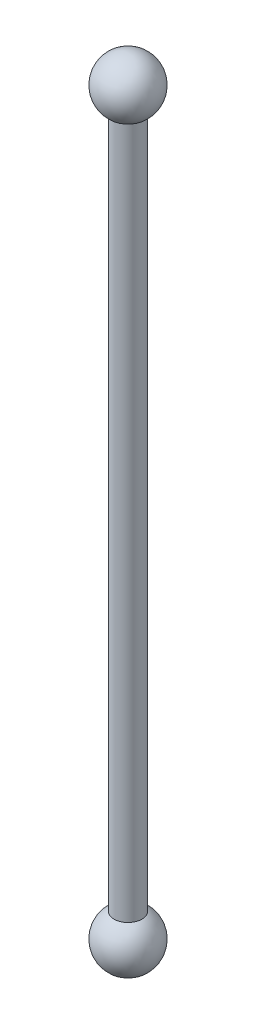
from build123d import *

# Parameters (mm, degrees)
SKETCH_2_R      = 7.5
EXTRUDE_1_DEPTH = 400


with BuildPart() as part:
    # Sketch 1 → Revolve 3 (revolve)
    with BuildSketch(Plane.XY):
        with BuildLine():
            Line((0, 15), (0, -15))
            ThreePointArc((0, -15), (15, 0), (0, 15))
        make_face()
    revolve(axis=Axis((0, 67.931152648, 0), (0, -1, 0)))

    # Sketch 2 → Extrude 1 (add)
    with BuildSketch(Plane(origin=(0, 0, 0), x_dir=(1, 0, 0), z_dir=(0, 1, 0))):
        with Locations(Location((0, 0, 0), (0, 0, 90))):
            Circle(SKETCH_2_R)
    extrude(amount=EXTRUDE_1_DEPTH)

    # Sketch 3 → Revolve 4 (revolve)
    with BuildSketch(Plane.XY):
        with BuildLine():
            Line((0, 415), (0, 385))
            ThreePointArc((0, 385), (15, 400), (0, 415))
        make_face()
    revolve(axis=Axis((0, 425.997925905, 0), (0, -1, 0)))


solid = part.part
